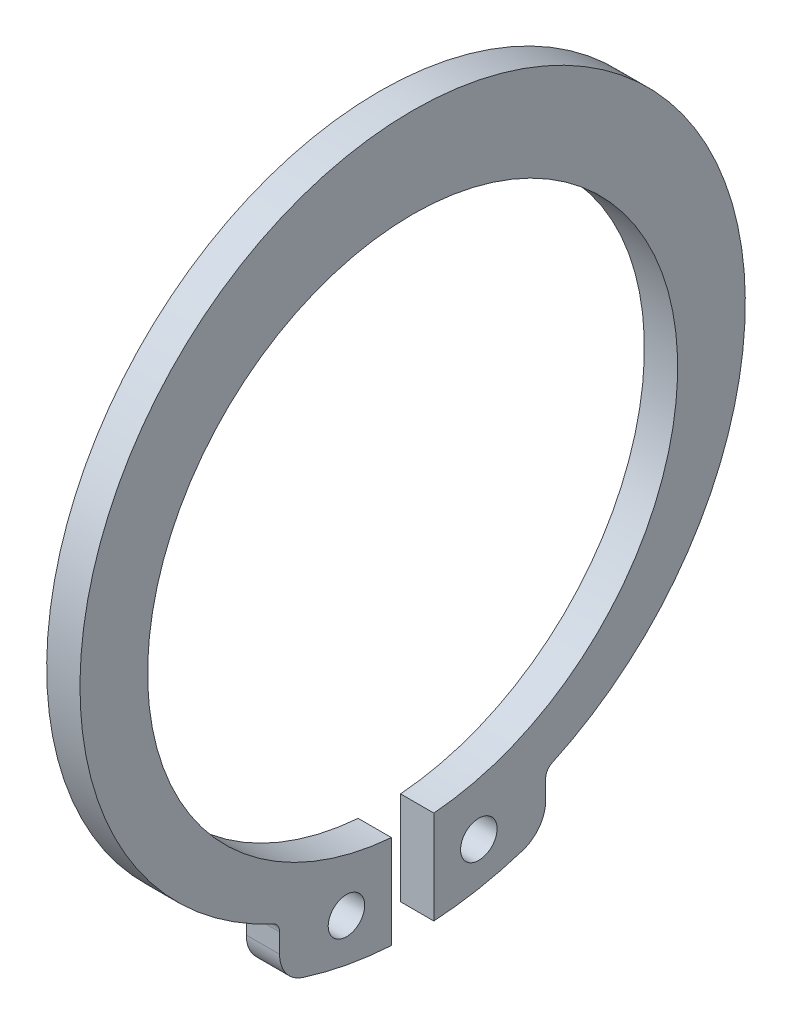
from build123d import *

# Parameters (mm, degrees)
ESQUISSE1_R          = 0.823144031
BASE_EXTRUSION_DEPTH = 1.5


with BuildPart() as part:
    # Esquisse1 → Base-Extrusion (new body)
    with BuildSketch(Plane(origin=(0, 0, 0), x_dir=(0, 0, -1), z_dir=(1, 0, 0))):
        with BuildLine():
            Line((0.956, -11.911698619), (0.956, -16.127184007))
            ThreePointArc((0.956, -16.127184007), (2.982095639, -15.877881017), (4.960578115, -15.375066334))
            ThreePointArc((4.960578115, -15.375066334), (5.71261436, -14.830457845), (6, -13.947527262))
            Line((6, -13.947527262), (6, -13.071247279))
            ThreePointArc((6, -13.071247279), (6.07878823, -12.801839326), (6.290322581, -12.617336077))
            ThreePointArc((6.290322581, -12.617336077), (0, 16), (-6.290322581, -12.617336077))
            ThreePointArc((-6.290322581, -12.617336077), (-6.07878823, -12.801839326), (-6, -13.071247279))
            Line((-6, -13.071247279), (-6, -13.947527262))
            ThreePointArc((-6, -13.947527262), (-5.71261436, -14.830457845), (-4.960578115, -15.375066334))
            ThreePointArc((-4.960578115, -15.375066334), (-2.982095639, -15.877881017), (-0.956, -16.127184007))
            Line((-0.956, -16.127184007), (-0.956, -11.911698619))
            ThreePointArc((-0.956, -11.911698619), (0, 11.95), (0.956, -11.911698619))
        make_face()
        with Locations((2.983897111, -13.947527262)):
            Circle(ESQUISSE1_R, mode=Mode.SUBTRACT)
        with Locations(Location((-2.983897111, -13.947527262, 0), (0, 0, 180))):
            Circle(ESQUISSE1_R, mode=Mode.SUBTRACT)
    extrude(amount=BASE_EXTRUSION_DEPTH)


solid = part.part
